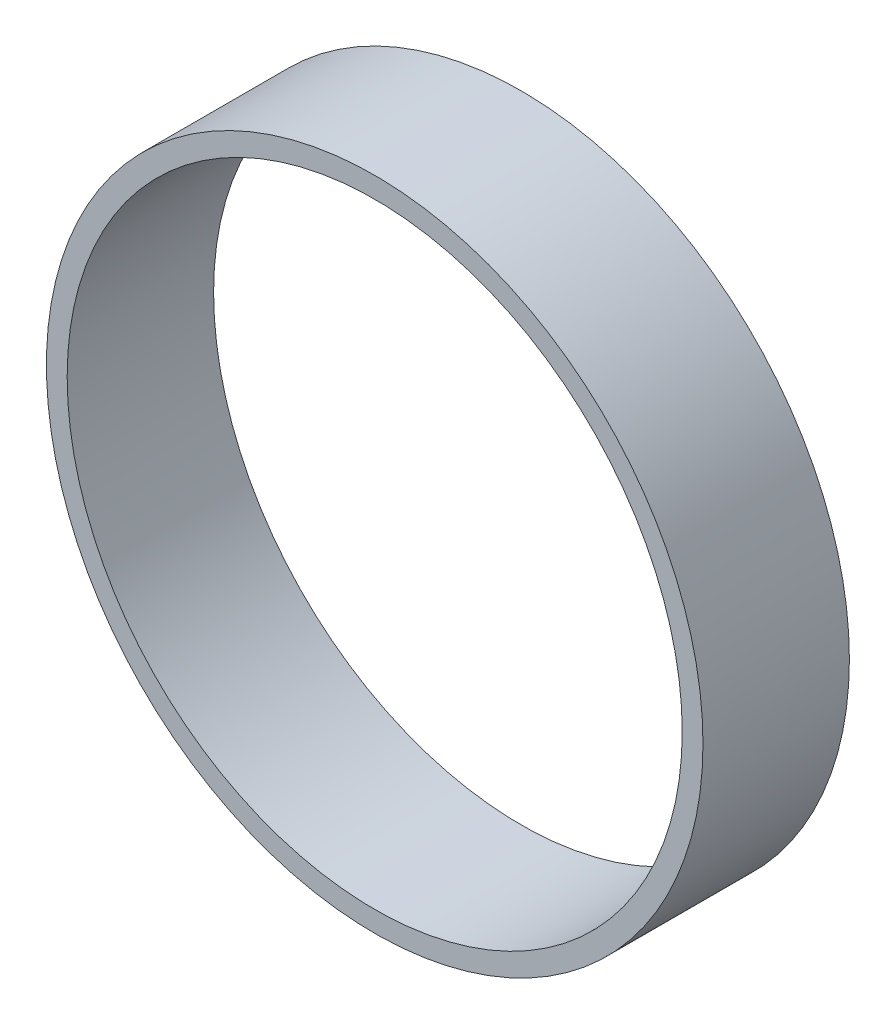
ISO-10303-21;
HEADER;
FILE_DESCRIPTION(('STEP AP214'),'2;1');
FILE_NAME('part.step','',(''),(''),'','','');
FILE_SCHEMA(('AUTOMOTIVE_DESIGN { 1 0 10303 214 1 1 1 1 }'));
ENDSEC;
DATA;
#1=APPLICATION_CONTEXT('core data for automotive mechanical design processes');
#2=APPLICATION_PROTOCOL_DEFINITION('international standard','automotive_design',2000,#1);
#3=PRODUCT_CONTEXT('',#1,'mechanical');
#4=PRODUCT('Part','Part','',(#3));
#5=PRODUCT_RELATED_PRODUCT_CATEGORY('part','',(#4));
#6=PRODUCT_DEFINITION_FORMATION('','',#4);
#7=PRODUCT_DEFINITION_CONTEXT('part definition',#1,'design');
#8=PRODUCT_DEFINITION('design','',#6,#7);
#9=PRODUCT_DEFINITION_SHAPE('','',#8);
#10=(LENGTH_UNIT() NAMED_UNIT(*) SI_UNIT(.MILLI.,.METRE.));
#11=(NAMED_UNIT(*) PLANE_ANGLE_UNIT() SI_UNIT($,.RADIAN.));
#12=(NAMED_UNIT(*) SI_UNIT($,.STERADIAN.) SOLID_ANGLE_UNIT());
#13=UNCERTAINTY_MEASURE_WITH_UNIT(LENGTH_MEASURE(1.E-05),#10,'distance_accuracy_value','');
#14=(GEOMETRIC_REPRESENTATION_CONTEXT(3) GLOBAL_UNCERTAINTY_ASSIGNED_CONTEXT((#13)) GLOBAL_UNIT_ASSIGNED_CONTEXT((#10,
#11,#12)) REPRESENTATION_CONTEXT('',''));
#15=CARTESIAN_POINT('',(0.,0.,0.));
#16=DIRECTION('',(0.,0.,1.));
#17=DIRECTION('',(1.,0.,0.));
#18=AXIS2_PLACEMENT_3D('',#15,#16,#17);
#19=CARTESIAN_POINT('',(0.,0.,12.7));
#20=DIRECTION('',(0.,0.,1.));
#21=DIRECTION('',(1.,0.,0.));
#22=AXIS2_PLACEMENT_3D('',#19,#20,#21);
#23=PLANE('',#22);
#24=CARTESIAN_POINT('',(0.,0.,12.7));
#25=DIRECTION('',(0.,0.,1.));
#26=DIRECTION('',(1.,0.,0.));
#27=AXIS2_PLACEMENT_3D('',#24,#25,#26);
#28=CIRCLE('',#27,56.95);
#29=CARTESIAN_POINT('',(56.95,0.,12.7));
#30=VERTEX_POINT('',#29);
#31=EDGE_CURVE('E10',#30,#30,#28,.T.);
#32=ORIENTED_EDGE('',*,*,#31,.T.);
#33=EDGE_LOOP('',(#32));
#34=FACE_BOUND('',#33,.T.);
#35=CARTESIAN_POINT('',(0.,0.,12.7));
#36=DIRECTION('',(0.,0.,1.));
#37=DIRECTION('',(1.,0.,0.));
#38=AXIS2_PLACEMENT_3D('',#35,#36,#37);
#39=CIRCLE('',#38,53.35);
#40=CARTESIAN_POINT('',(53.35,0.,12.7));
#41=VERTEX_POINT('',#40);
#42=EDGE_CURVE('E42',#41,#41,#39,.T.);
#43=ORIENTED_EDGE('',*,*,#42,.F.);
#44=EDGE_LOOP('',(#43));
#45=FACE_BOUND('',#44,.T.);
#46=ADVANCED_FACE('F31',(#34,#45),#23,.T.);
#47=CARTESIAN_POINT('',(0.,0.,-12.7));
#48=DIRECTION('',(0.,0.,1.));
#49=DIRECTION('',(1.,0.,0.));
#50=AXIS2_PLACEMENT_3D('',#47,#48,#49);
#51=PLANE('',#50);
#52=CARTESIAN_POINT('',(0.,0.,-12.7));
#53=DIRECTION('',(0.,0.,1.));
#54=DIRECTION('',(1.,0.,0.));
#55=AXIS2_PLACEMENT_3D('',#52,#53,#54);
#56=CIRCLE('',#55,56.95);
#57=CARTESIAN_POINT('',(56.95,0.,-12.7));
#58=VERTEX_POINT('',#57);
#59=EDGE_CURVE('E35',#58,#58,#56,.T.);
#60=ORIENTED_EDGE('',*,*,#59,.F.);
#61=EDGE_LOOP('',(#60));
#62=FACE_BOUND('',#61,.T.);
#63=CARTESIAN_POINT('',(0.,0.,-12.7));
#64=DIRECTION('',(0.,0.,1.));
#65=DIRECTION('',(1.,0.,0.));
#66=AXIS2_PLACEMENT_3D('',#63,#64,#65);
#67=CIRCLE('',#66,53.35);
#68=CARTESIAN_POINT('',(53.35,0.,-12.7));
#69=VERTEX_POINT('',#68);
#70=EDGE_CURVE('E44',#69,#69,#67,.T.);
#71=ORIENTED_EDGE('',*,*,#70,.T.);
#72=EDGE_LOOP('',(#71));
#73=FACE_BOUND('',#72,.T.);
#74=ADVANCED_FACE('F54',(#62,#73),#51,.F.);
#75=CARTESIAN_POINT('',(0.,0.,12.7));
#76=DIRECTION('',(0.,0.,-1.));
#77=DIRECTION('',(-1.,0.,0.));
#78=AXIS2_PLACEMENT_3D('',#75,#76,#77);
#79=CYLINDRICAL_SURFACE('',#78,56.95);
#80=ORIENTED_EDGE('',*,*,#31,.F.);
#81=EDGE_LOOP('',(#80));
#82=FACE_BOUND('',#81,.T.);
#83=ORIENTED_EDGE('',*,*,#59,.T.);
#84=EDGE_LOOP('',(#83));
#85=FACE_BOUND('',#84,.T.);
#86=ADVANCED_FACE('F33',(#82,#85),#79,.T.);
#87=CARTESIAN_POINT('',(0.,0.,12.7));
#88=DIRECTION('',(0.,0.,-1.));
#89=DIRECTION('',(-1.,0.,0.));
#90=AXIS2_PLACEMENT_3D('',#87,#88,#89);
#91=CYLINDRICAL_SURFACE('',#90,53.35);
#92=ORIENTED_EDGE('',*,*,#42,.T.);
#93=EDGE_LOOP('',(#92));
#94=FACE_BOUND('',#93,.T.);
#95=ORIENTED_EDGE('',*,*,#70,.F.);
#96=EDGE_LOOP('',(#95));
#97=FACE_BOUND('',#96,.T.);
#98=ADVANCED_FACE('F50',(#94,#97),#91,.F.);
#99=CLOSED_SHELL('',(#46,#74,#86,#98));
#100=MANIFOLD_SOLID_BREP('B2',#99);
#101=ADVANCED_BREP_SHAPE_REPRESENTATION('',(#18,#100),#14);
#102=SHAPE_DEFINITION_REPRESENTATION(#9,#101);
ENDSEC;
END-ISO-10303-21;
